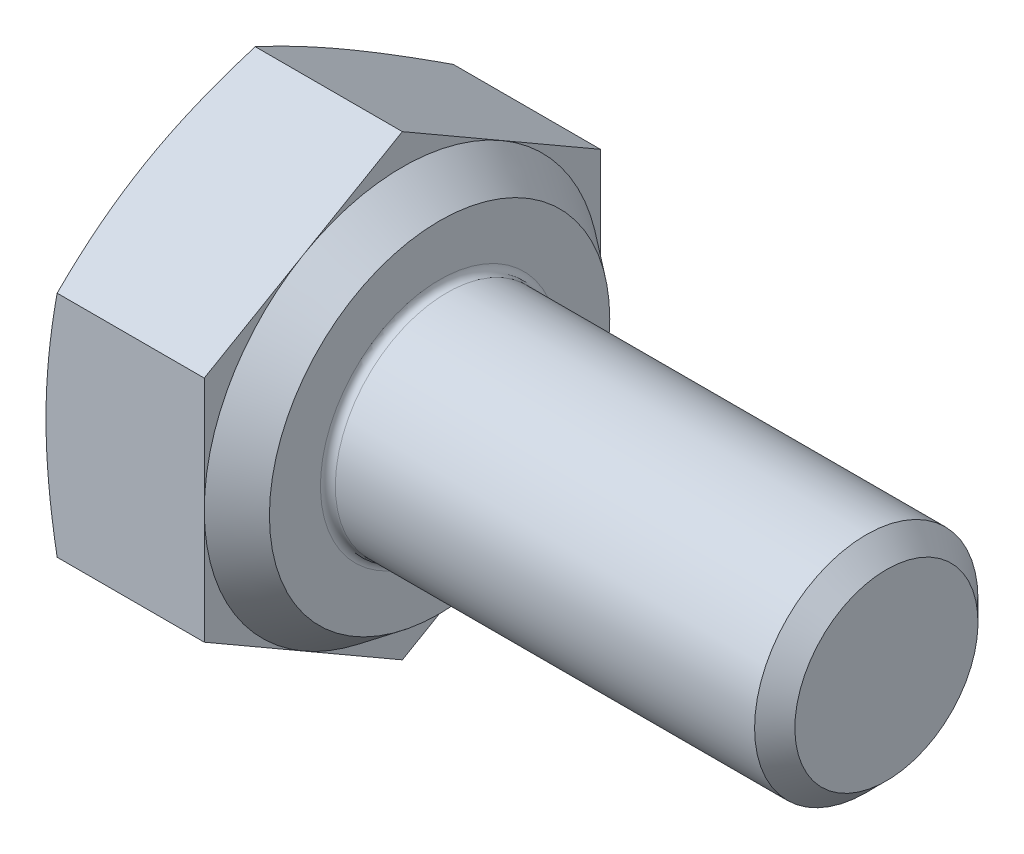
from build123d import *

# Parameters (mm, degrees)
BASEHEAD_DEPTH = 2.125
SKETCH3_R      = 1.5
BASEBODY_DEPTH = 6
CHAMFER1_SIZE  = 0.2705
HEADFILLET_R   = 0.1


with BuildPart() as part:
    # Sketch-BaseHead → BaseHead (new body)
    with BuildSketch(Plane(origin=(0, 0, 0), x_dir=(0, 0, -1), z_dir=(1, 0, 0))):
        Polygon((0, -3.071503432), (2.66, -1.535751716), (2.66, 1.535751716), (0, 3.071503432), (-2.66, 1.535751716), (-2.66, -1.535751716), align=None)
    extrude(amount=BASEHEAD_DEPTH)

    # Sketch4 → HeadChamfer (revolve, cut)
    with BuildSketch(Plane(origin=(-0.264637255, -5.916896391, 0), x_dir=(0, 1, 0), z_dir=(0, 0, 1))):
        Polygon((8.988399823, -0.264637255), (8.576896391, -0.264637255), (8.988399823, -0.414412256), align=None)
    revolve(axis=Axis((-4.001564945, 0, 0), (1, 0, 0)), mode=Mode.SUBTRACT)

    # Sketch1 → Revolve1 (revolve)
    with BuildSketch(Plane(origin=(0, 0, 0), x_dir=(1, 0, 0), z_dir=(0, 1, 0)), mode=Mode.PRIVATE) as revolve1_sk:
        Polygon((2.125, 0), (2.625, 0), (2.625, 2.285), (2.125, 2.66), align=None)
    revolve(revolve1_sk.sketch.rotate(Axis((-4.001564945, 0, 0), (1, 0, 0)), 270), axis=Axis((-4.001564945, 0, 0), (1, 0, 0)))

    # Sketch3 → BaseBody (add)
    with BuildSketch(Plane(origin=(2.625, 0, 0), x_dir=(0, 0, -1), z_dir=(1, 0, 0))):
        with Locations(Location((0, 0, 0), (0, 0, 270))):
            Circle(SKETCH3_R)
    extrude(amount=BASEBODY_DEPTH)

    # Chamfer1
    chamfer1_edges = [part.edges().sort_by_distance(p)[0] for p in [
        (8.625, 1.5, 0),
    ]]
    chamfer(chamfer1_edges, length=CHAMFER1_SIZE)

    # HeadFillet
    headfillet_edges = [part.edges().sort_by_distance(p)[0] for p in [
        (2.625, 1.5, 0),
    ]]
    fillet(headfillet_edges, radius=HEADFILLET_R)


solid = part.part
